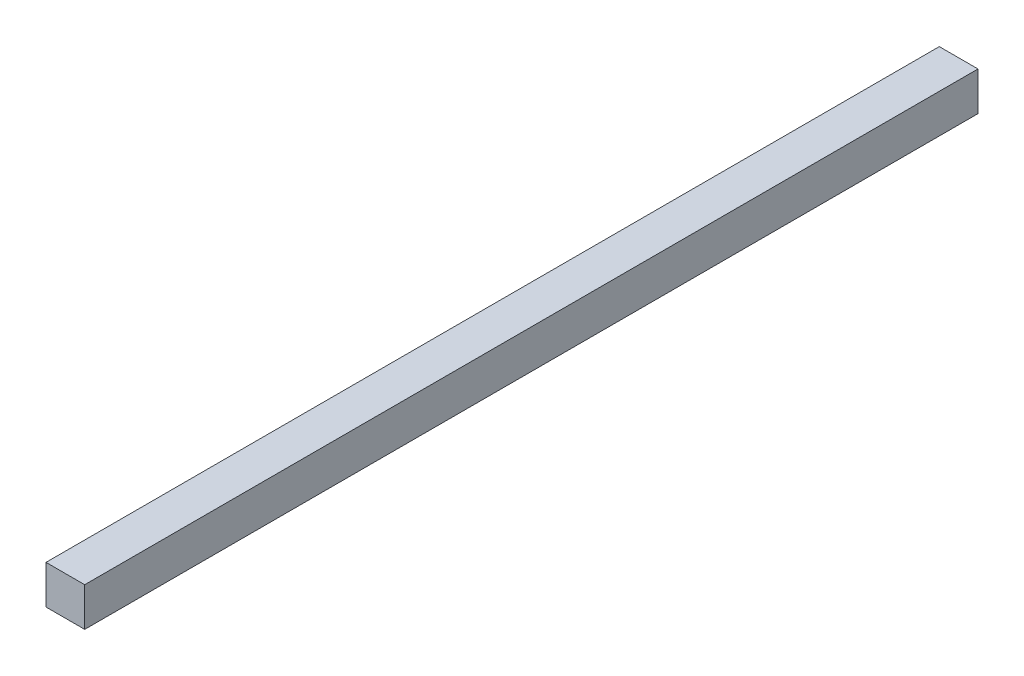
from build123d import *

# Parameters (mm, degrees)
ESQUISSE1_W      = 13
ESQUISSE1_H      = 13
EXTRUSION1_DEPTH = 150


with BuildPart() as part:
    # Esquisse1 → Extrusion1 (new, symmetric)
    with BuildSketch(Plane.XY):
        Rectangle(ESQUISSE1_W, ESQUISSE1_H)
    extrude(amount=EXTRUSION1_DEPTH, both=True)


solid = part.part
